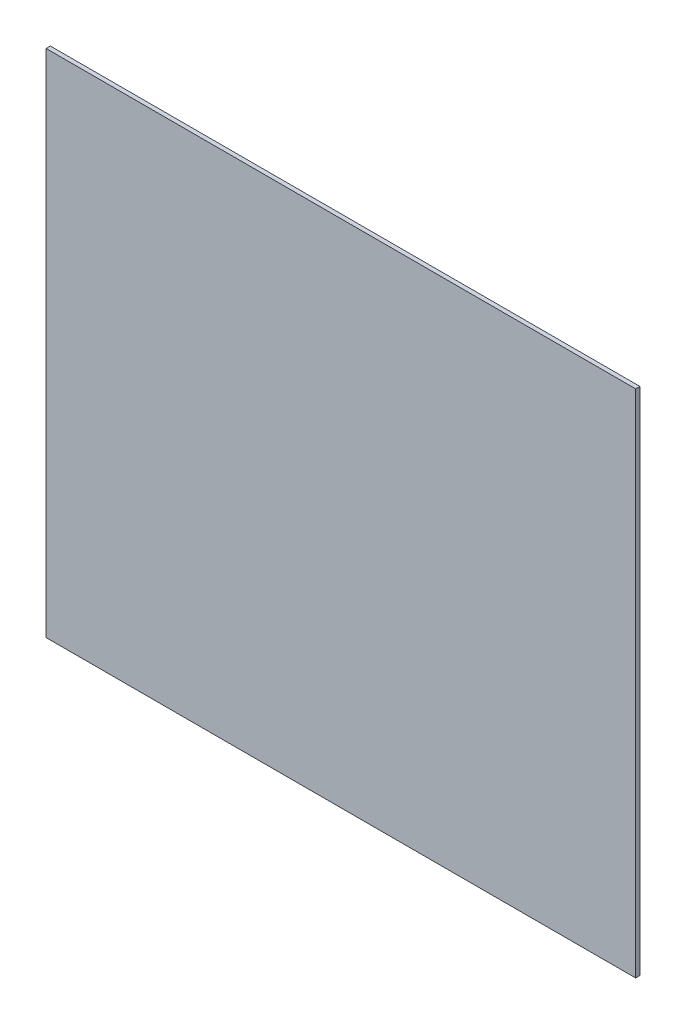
from build123d import *

# Parameters (mm, degrees)
SKETCH1_W           = 660.4
SKETCH1_H           = 571.5
BOSS_EXTRUDE1_DEPTH = 4.7625


with BuildPart() as part:
    # Sketch1 → Boss-Extrude1 (new body)
    with BuildSketch(Plane.XY):
        Rectangle(SKETCH1_W, SKETCH1_H)
    extrude(amount=BOSS_EXTRUDE1_DEPTH)


solid = part.part
